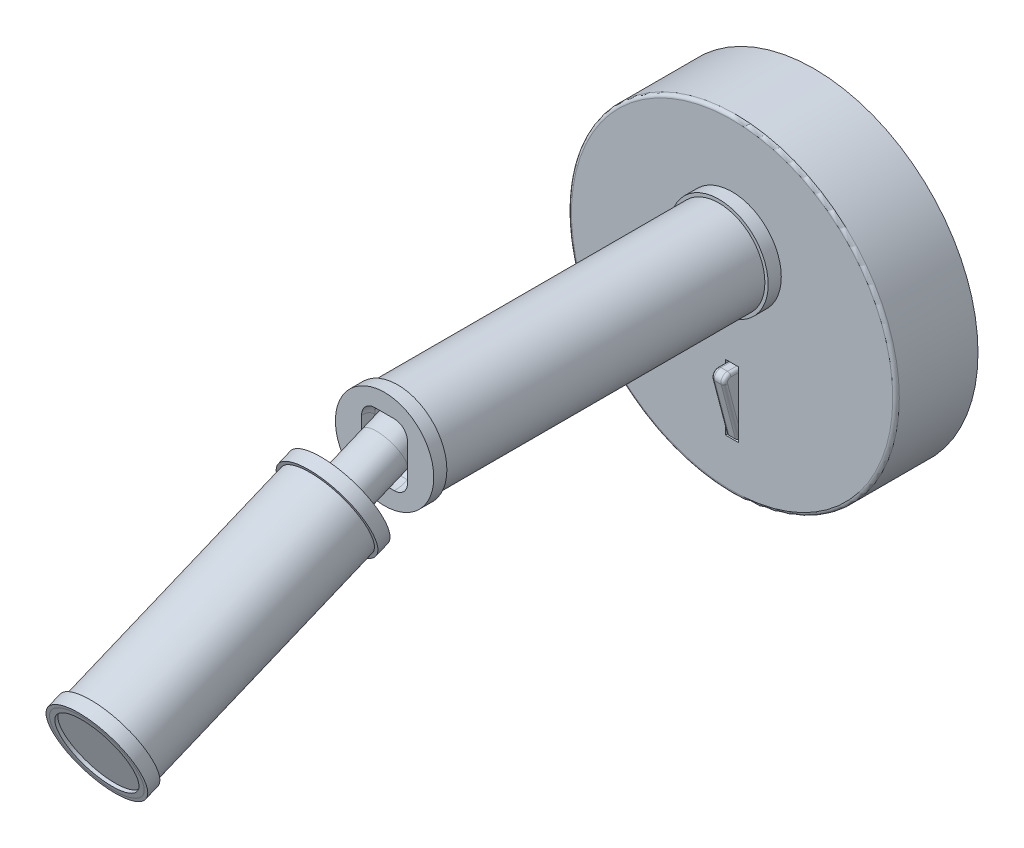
from build123d import *

# Parameters (mm, degrees)
CROQUIS1_R              = 50
SALIENTE_EXTRUIR1_DEPTH = 25
CROQUIS2_R              = 15
SALIENTE_EXTRUIR2_DEPTH = 4
CROQUIS3_R              = 14
SALIENTE_EXTRUIR3_DEPTH = 98
CROQUIS4_R              = 15
SALIENTE_EXTRUIR4_DEPTH = 4
CROQUIS5_R              = 9.488847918
CORTAR_EXTRUIR1_DEPTH   = 7
BARRER1_PROFILE_R       = 6.5
CROQUIS25_R             = 13.5
SALIENTE_EXTRUIR5_DEPTH = 80
CROQUIS26_R             = 12
CORTAR_EXTRUIR2_DEPTH   = 2
CROQUIS27_R             = 12
SALIENTE_EXTRUIR6_DEPTH = 1
REDONDEO1_R             = 4
CROQUIS28_W             = 4
CROQUIS28_H             = 20
CORTAR_EXTRUIR3_DEPTH   = 5
SALIENTE_EXTRUIR7_DEPTH = 2
REDONDEO2_R             = 2
REDONDEO3_R             = 1
REDONDEO4_R             = 1
CROQUIS31_R             = 14.5
CROQUIS31_R_2           = 13.5
SALIENTE_EXTRUIR8_DEPTH = 4
CROQUIS32_R             = 14.5
CROQUIS32_R_2           = 13.5
SALIENTE_EXTRUIR9_DEPTH = 4


with BuildPart() as part:
    # Croquis1 → Saliente-Extruir1 (new body)
    with BuildSketch(Plane.XY):
        Circle(CROQUIS1_R)
    extrude(amount=SALIENTE_EXTRUIR1_DEPTH)

    # Croquis28 → Cortar-Extruir3 (cut)
    with BuildSketch(Plane.XY.offset(25)):
        with Locations((0, -25.295518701)):
            Rectangle(CROQUIS28_W, CROQUIS28_H)
    extrude(amount=-CORTAR_EXTRUIR3_DEPTH, mode=Mode.SUBTRACT)

    # Redondeo4
    redondeo4_edges = [part.edges().sort_by_distance(p)[0] for p in [
        (-50, 0, 25),
    ]]
    fillet(redondeo4_edges, radius=REDONDEO4_R)


with BuildPart() as body_2:
    # Croquis2 → Saliente-Extruir2 (new body)
    with BuildSketch(Plane.XY.offset(25)):
        with Locations((0, 15)):
            Circle(CROQUIS2_R)
    extrude(amount=SALIENTE_EXTRUIR2_DEPTH)


with BuildPart() as body_3:
    # Croquis3 → Saliente-Extruir3 (new body)
    with BuildSketch(Plane.XY.offset(29)):
        with Locations((0, 15)):
            Circle(CROQUIS3_R)
    extrude(amount=SALIENTE_EXTRUIR3_DEPTH)


with BuildPart() as body_4:
    # Croquis4 → Saliente-Extruir4 (new body)
    with BuildSketch(Plane.XY.offset(127)):
        with Locations((0, 15)):
            Circle(CROQUIS4_R)
    extrude(amount=SALIENTE_EXTRUIR4_DEPTH)


with BuildPart() as cortar_extruir1_tool:
    # Croquis5 → Cortar-Extruir1 (new, symmetric)
    with BuildSketch(Plane(origin=(0, 0, 0), x_dir=(0, 0, -1), z_dir=(1, 0, 0))):
        with Locations((-131, 15)):
            Circle(CROQUIS5_R)
    extrude(amount=CORTAR_EXTRUIR1_DEPTH, both=True)


with BuildPart() as body_3_1:
    add(body_3.part)

    # Cortar-Extruir1: cut by cortar_extruir1_tool
    add(cortar_extruir1_tool.part, mode=Mode.SUBTRACT)


with BuildPart() as body_4_1:
    add(body_4.part)

    # Cortar-Extruir1: cut by cortar_extruir1_tool
    add(cortar_extruir1_tool.part, mode=Mode.SUBTRACT)

    # Redondeo1
    redondeo1_edges = [body_4_1.edges().sort_by_distance(p)[0] for p in [
        (-7, 24.265135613, 128.95170879),
        (7, 5.734864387, 128.95170879),
        (7, 24.265135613, 128.95170879),
        (-7, 5.734864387, 128.95170879),
    ]]
    fillet(redondeo1_edges, radius=REDONDEO1_R)


with BuildPart() as body_5:
    # Barrer1: sweep along a path in Croquis6
    with BuildLine(Plane(origin=(0, 0, 0), x_dir=(0, 0, -1), z_dir=(1, 0, 0))) as barrer1_path:
        Line((-144.855797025, 9.25396756), (-131, 15))
        Line((-131, 15), (-117.52454837, 20.588302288))
    # Barrer1 profile (on start of the path) → Barrer1 (sweep)
    with BuildSketch(Plane(origin=(0, 9.25396756, 144.855797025), x_dir=(0, -0.9237198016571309, -0.38306882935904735), z_dir=(0, 0.38306882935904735, -0.9237198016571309))):
        Circle(BARRER1_PROFILE_R)
    sweep(path=barrer1_path.line)


with BuildPart() as body_6:
    # Croquis25 → Saliente-Extruir5 (new body)
    with BuildSketch(Plane(origin=(0, -49.899028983, 120.324906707), x_dir=(1, 0, 0), z_dir=(0, -0.3830688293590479, 0.9237198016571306))):
        with Locations(Location((0, 64.037813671, 0), (0, 0, 270))):
            Circle(CROQUIS25_R)
    extrude(amount=SALIENTE_EXTRUIR5_DEPTH)

    # Croquis26 → Cortar-Extruir2 (cut)
    with BuildSketch(Plane(origin=(0, -80.544535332, 194.22249084), x_dir=(1, 0, 0), z_dir=(0, -0.38306882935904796, 0.9237198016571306))):
        with Locations(Location((0, 64.037813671, 0), (0, 0, 270))):
            Circle(CROQUIS26_R)
    extrude(amount=-CORTAR_EXTRUIR2_DEPTH, mode=Mode.SUBTRACT)


with BuildPart() as body_7:
    # Croquis27 → Saliente-Extruir6 (new body)
    with BuildSketch(Plane(origin=(0, -79.778397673, 192.375051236), x_dir=(1, 0, 0), z_dir=(0, -0.383068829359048, 0.9237198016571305))):
        with Locations(Location((0, 64.037813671, 0), (0, 0, 270))):
            Circle(CROQUIS27_R)
    extrude(amount=SALIENTE_EXTRUIR6_DEPTH)


with BuildPart() as body_8:
    # Croquis30 → Saliente-Extruir7 (new, symmetric)
    with BuildSketch(Plane(origin=(0, 0, 0), x_dir=(0, 0, -1), z_dir=(1, 0, 0))):
        Polygon((-20, -15.742880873), (-30, -15.742880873), (-25, -34.820044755), (-20, -34.820044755), align=None)
    extrude(amount=SALIENTE_EXTRUIR7_DEPTH, both=True)

    # Redondeo2
    redondeo2_edges = [body_8.edges().sort_by_distance(p)[0] for p in [
        (0, -15.742880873, 30),
    ]]
    fillet(redondeo2_edges, radius=REDONDEO2_R)

    # Redondeo3
    redondeo3_edges = [body_8.edges().sort_by_distance(p)[0] for p in [
        (-2, -26.534993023, 27.171457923),
        (2, -26.534993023, 27.171457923),
        (-2, -16.521021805, 28.991630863),
        (2, -16.521021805, 28.991630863),
        (-2, -15.742880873, 23.704130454),
        (2, -15.742880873, 23.704130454),
    ]]
    fillet(redondeo3_edges, radius=REDONDEO3_R)


with BuildPart() as body_9:
    # Croquis31 → Saliente-Extruir8 (new body)
    with BuildSketch(Plane(origin=(0, -80.544535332, 194.22249084), x_dir=(1, 0, 0), z_dir=(0, -0.38306882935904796, 0.9237198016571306))):
        with Locations(Location((0, 64.037813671, 0), (0, 0, 270))):
            Circle(CROQUIS31_R)
        with Locations(Location((0, 64.037813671, 0), (0, 0, 270))):
            Circle(CROQUIS31_R_2, mode=Mode.SUBTRACT)
    extrude(amount=-SALIENTE_EXTRUIR8_DEPTH)


with BuildPart() as body_10:
    # Croquis32 → Saliente-Extruir9 (new body)
    with BuildSketch(Plane(origin=(0, -49.899028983, 120.324906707), x_dir=(-1, 0, 0), z_dir=(0, 0.38306882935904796, -0.9237198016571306))):
        with Locations(Location((0, 64.037813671, 0), (0, 0, 90))):
            Circle(CROQUIS32_R)
        with Locations(Location((0, 64.037813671, 0), (0, 0, 90))):
            Circle(CROQUIS32_R_2, mode=Mode.SUBTRACT)
    extrude(amount=-SALIENTE_EXTRUIR9_DEPTH)


solid = Compound([part.part, body_2.part, body_3_1.part, body_4_1.part, body_5.part, body_6.part, body_7.part, body_8.part, body_9.part, body_10.part])
